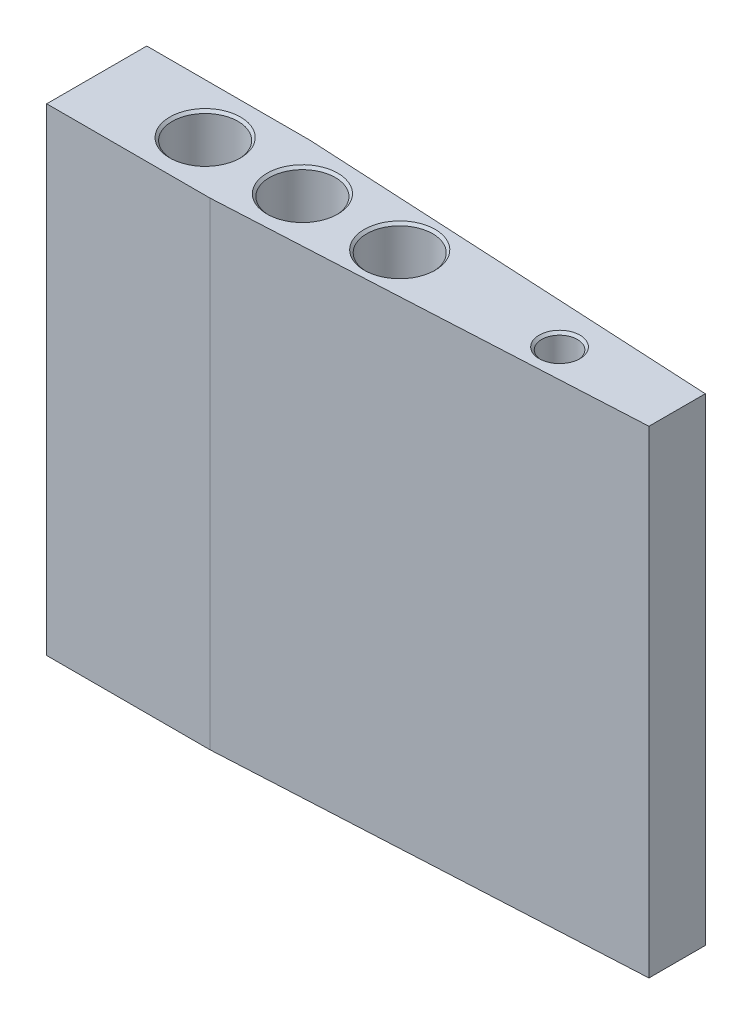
ISO-10303-21;
HEADER;
FILE_DESCRIPTION(('STEP AP214'),'2;1');
FILE_NAME('part.step','',(''),(''),'','','');
FILE_SCHEMA(('AUTOMOTIVE_DESIGN { 1 0 10303 214 1 1 1 1 }'));
ENDSEC;
DATA;
#1=APPLICATION_CONTEXT('core data for automotive mechanical design processes');
#2=APPLICATION_PROTOCOL_DEFINITION('international standard','automotive_design',2000,#1);
#3=PRODUCT_CONTEXT('',#1,'mechanical');
#4=PRODUCT('Part','Part','',(#3));
#5=PRODUCT_RELATED_PRODUCT_CATEGORY('part','',(#4));
#6=PRODUCT_DEFINITION_FORMATION('','',#4);
#7=PRODUCT_DEFINITION_CONTEXT('part definition',#1,'design');
#8=PRODUCT_DEFINITION('design','',#6,#7);
#9=PRODUCT_DEFINITION_SHAPE('','',#8);
#10=(LENGTH_UNIT() NAMED_UNIT(*) SI_UNIT(.MILLI.,.METRE.));
#11=(NAMED_UNIT(*) PLANE_ANGLE_UNIT() SI_UNIT($,.RADIAN.));
#12=(NAMED_UNIT(*) SI_UNIT($,.STERADIAN.) SOLID_ANGLE_UNIT());
#13=UNCERTAINTY_MEASURE_WITH_UNIT(LENGTH_MEASURE(1.E-05),#10,'distance_accuracy_value','');
#14=(GEOMETRIC_REPRESENTATION_CONTEXT(3) GLOBAL_UNCERTAINTY_ASSIGNED_CONTEXT((#13)) GLOBAL_UNIT_ASSIGNED_CONTEXT((#10,
#11,#12)) REPRESENTATION_CONTEXT('',''));
#15=CARTESIAN_POINT('',(0.,0.,0.));
#16=DIRECTION('',(0.,0.,1.));
#17=DIRECTION('',(1.,0.,0.));
#18=AXIS2_PLACEMENT_3D('',#15,#16,#17);
#19=CARTESIAN_POINT('',(19.5809830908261,68.2269070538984,-6.));
#20=DIRECTION('',(-0.0523359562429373,0.,0.998629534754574));
#21=DIRECTION('',(0.998629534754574,0.,0.0523359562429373));
#22=AXIS2_PLACEMENT_3D('',#19,#20,#21);
#23=PLANE('',#22);
#24=DIRECTION('',(-0.998629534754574,0.,-0.0523359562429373));
#25=VECTOR('',#24,1.);
#26=CARTESIAN_POINT('',(19.5809830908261,-2.4,-6.));
#27=LINE('',#26,#25);
#28=CARTESIAN_POINT('',(69.6,-2.4,-3.37861440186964));
#29=VERTEX_POINT('',#28);
#30=CARTESIAN_POINT('',(19.5809830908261,-2.4,-6.));
#31=VERTEX_POINT('',#30);
#32=EDGE_CURVE('E117',#29,#31,#27,.T.);
#33=ORIENTED_EDGE('',*,*,#32,.F.);
#34=DIRECTION('',(0.,-1.,0.));
#35=VECTOR('',#34,1.);
#36=CARTESIAN_POINT('',(69.6,68.2269070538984,-3.37861440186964));
#37=LINE('',#36,#35);
#38=CARTESIAN_POINT('',(69.6,-59.7,-3.37861440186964));
#39=VERTEX_POINT('',#38);
#40=EDGE_CURVE('E52',#29,#39,#37,.T.);
#41=ORIENTED_EDGE('',*,*,#40,.T.);
#42=DIRECTION('',(-0.998629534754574,0.,-0.0523359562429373));
#43=VECTOR('',#42,1.);
#44=CARTESIAN_POINT('',(19.5809830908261,-59.7,-6.));
#45=LINE('',#44,#43);
#46=CARTESIAN_POINT('',(19.5809830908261,-59.7,-6.));
#47=VERTEX_POINT('',#46);
#48=EDGE_CURVE('E125',#39,#47,#45,.T.);
#49=ORIENTED_EDGE('',*,*,#48,.T.);
#50=DIRECTION('',(0.,-1.,0.));
#51=VECTOR('',#50,1.);
#52=CARTESIAN_POINT('',(19.5809830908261,68.2269070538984,-6.));
#53=LINE('',#52,#51);
#54=EDGE_CURVE('E83',#31,#47,#53,.T.);
#55=ORIENTED_EDGE('',*,*,#54,.F.);
#56=EDGE_LOOP('',(#33,#41,#49,#55));
#57=FACE_BOUND('',#56,.T.);
#58=ADVANCED_FACE('F35',(#57),#23,.F.);
#59=CARTESIAN_POINT('',(0.,68.2269070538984,-6.00000000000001));
#60=DIRECTION('',(0.,0.,1.));
#61=DIRECTION('',(1.,0.,0.));
#62=AXIS2_PLACEMENT_3D('',#59,#60,#61);
#63=PLANE('',#62);
#64=DIRECTION('',(-1.,0.,0.));
#65=VECTOR('',#64,1.);
#66=CARTESIAN_POINT('',(0.,-2.4,-6.00000000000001));
#67=LINE('',#66,#65);
#68=CARTESIAN_POINT('',(0.,-2.4,-6.00000000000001));
#69=VERTEX_POINT('',#68);
#70=EDGE_CURVE('E90',#31,#69,#67,.T.);
#71=ORIENTED_EDGE('',*,*,#70,.F.);
#72=ORIENTED_EDGE('',*,*,#54,.T.);
#73=DIRECTION('',(-1.,0.,0.));
#74=VECTOR('',#73,1.);
#75=CARTESIAN_POINT('',(0.,-59.7,-6.00000000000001));
#76=LINE('',#75,#74);
#77=CARTESIAN_POINT('',(0.,-59.7,-6.00000000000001));
#78=VERTEX_POINT('',#77);
#79=EDGE_CURVE('E124',#47,#78,#76,.T.);
#80=ORIENTED_EDGE('',*,*,#79,.T.);
#81=DIRECTION('',(0.,-1.,0.));
#82=VECTOR('',#81,1.);
#83=CARTESIAN_POINT('',(0.,68.2269070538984,-6.00000000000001));
#84=LINE('',#83,#82);
#85=EDGE_CURVE('E126',#69,#78,#84,.T.);
#86=ORIENTED_EDGE('',*,*,#85,.F.);
#87=EDGE_LOOP('',(#71,#72,#80,#86));
#88=FACE_BOUND('',#87,.T.);
#89=ADVANCED_FACE('F150',(#88),#63,.F.);
#90=CARTESIAN_POINT('',(0.,68.2269070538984,-6.00000000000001));
#91=DIRECTION('',(1.,0.,0.));
#92=DIRECTION('',(0.,0.,-1.));
#93=AXIS2_PLACEMENT_3D('',#90,#91,#92);
#94=PLANE('',#93);
#95=DIRECTION('',(0.,0.,1.));
#96=VECTOR('',#95,1.);
#97=CARTESIAN_POINT('',(0.,-2.4,-6.00000000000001));
#98=LINE('',#97,#96);
#99=CARTESIAN_POINT('',(0.,-2.4,5.99999999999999));
#100=VERTEX_POINT('',#99);
#101=EDGE_CURVE('E111',#69,#100,#98,.T.);
#102=ORIENTED_EDGE('',*,*,#101,.F.);
#103=ORIENTED_EDGE('',*,*,#85,.T.);
#104=DIRECTION('',(0.,0.,1.));
#105=VECTOR('',#104,1.);
#106=CARTESIAN_POINT('',(0.,-59.7,-6.00000000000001));
#107=LINE('',#106,#105);
#108=CARTESIAN_POINT('',(0.,-59.7,5.99999999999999));
#109=VERTEX_POINT('',#108);
#110=EDGE_CURVE('E128',#78,#109,#107,.T.);
#111=ORIENTED_EDGE('',*,*,#110,.T.);
#112=DIRECTION('',(0.,-1.,0.));
#113=VECTOR('',#112,1.);
#114=CARTESIAN_POINT('',(0.,68.2269070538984,5.99999999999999));
#115=LINE('',#114,#113);
#116=EDGE_CURVE('E129',#100,#109,#115,.T.);
#117=ORIENTED_EDGE('',*,*,#116,.F.);
#118=EDGE_LOOP('',(#102,#103,#111,#117));
#119=FACE_BOUND('',#118,.T.);
#120=ADVANCED_FACE('F155',(#119),#94,.F.);
#121=CARTESIAN_POINT('',(19.5809830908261,68.2269070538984,5.99999999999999));
#122=DIRECTION('',(0.,0.,-1.));
#123=DIRECTION('',(-1.,0.,0.));
#124=AXIS2_PLACEMENT_3D('',#121,#122,#123);
#125=PLANE('',#124);
#126=DIRECTION('',(1.,0.,0.));
#127=VECTOR('',#126,1.);
#128=CARTESIAN_POINT('',(19.5809830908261,-2.4,5.99999999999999));
#129=LINE('',#128,#127);
#130=CARTESIAN_POINT('',(19.5809830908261,-2.4,5.99999999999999));
#131=VERTEX_POINT('',#130);
#132=EDGE_CURVE('E44',#100,#131,#129,.T.);
#133=ORIENTED_EDGE('',*,*,#132,.F.);
#134=ORIENTED_EDGE('',*,*,#116,.T.);
#135=DIRECTION('',(1.,0.,0.));
#136=VECTOR('',#135,1.);
#137=CARTESIAN_POINT('',(19.5809830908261,-59.7,5.99999999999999));
#138=LINE('',#137,#136);
#139=CARTESIAN_POINT('',(19.5809830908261,-59.7,5.99999999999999));
#140=VERTEX_POINT('',#139);
#141=EDGE_CURVE('E106',#109,#140,#138,.T.);
#142=ORIENTED_EDGE('',*,*,#141,.T.);
#143=DIRECTION('',(0.,-1.,0.));
#144=VECTOR('',#143,1.);
#145=CARTESIAN_POINT('',(19.5809830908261,68.2269070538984,5.99999999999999));
#146=LINE('',#145,#144);
#147=EDGE_CURVE('E97',#131,#140,#146,.T.);
#148=ORIENTED_EDGE('',*,*,#147,.F.);
#149=EDGE_LOOP('',(#133,#134,#142,#148));
#150=FACE_BOUND('',#149,.T.);
#151=ADVANCED_FACE('F103',(#150),#125,.F.);
#152=CARTESIAN_POINT('',(69.6,68.2269070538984,3.37861440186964));
#153=DIRECTION('',(-0.0523359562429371,0.,-0.998629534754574));
#154=DIRECTION('',(-0.998629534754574,0.,0.0523359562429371));
#155=AXIS2_PLACEMENT_3D('',#152,#153,#154);
#156=PLANE('',#155);
#157=DIRECTION('',(0.998629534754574,0.,-0.0523359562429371));
#158=VECTOR('',#157,1.);
#159=CARTESIAN_POINT('',(69.6,-2.4,3.37861440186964));
#160=LINE('',#159,#158);
#161=CARTESIAN_POINT('',(69.6,-2.4,3.37861440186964));
#162=VERTEX_POINT('',#161);
#163=EDGE_CURVE('E11',#131,#162,#160,.T.);
#164=ORIENTED_EDGE('',*,*,#163,.F.);
#165=ORIENTED_EDGE('',*,*,#147,.T.);
#166=DIRECTION('',(0.998629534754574,0.,-0.0523359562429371));
#167=VECTOR('',#166,1.);
#168=CARTESIAN_POINT('',(69.6,-59.7,3.37861440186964));
#169=LINE('',#168,#167);
#170=CARTESIAN_POINT('',(69.6,-59.7,3.37861440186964));
#171=VERTEX_POINT('',#170);
#172=EDGE_CURVE('E108',#140,#171,#169,.T.);
#173=ORIENTED_EDGE('',*,*,#172,.T.);
#174=DIRECTION('',(0.,-1.,0.));
#175=VECTOR('',#174,1.);
#176=CARTESIAN_POINT('',(69.6,68.2269070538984,3.37861440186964));
#177=LINE('',#176,#175);
#178=EDGE_CURVE('E58',#162,#171,#177,.T.);
#179=ORIENTED_EDGE('',*,*,#178,.F.);
#180=EDGE_LOOP('',(#164,#165,#173,#179));
#181=FACE_BOUND('',#180,.T.);
#182=ADVANCED_FACE('F96',(#181),#156,.F.);
#183=CARTESIAN_POINT('',(69.6,68.2269070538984,-3.37861440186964));
#184=DIRECTION('',(-1.,0.,0.));
#185=DIRECTION('',(0.,0.,1.));
#186=AXIS2_PLACEMENT_3D('',#183,#184,#185);
#187=PLANE('',#186);
#188=DIRECTION('',(0.,0.,-1.));
#189=VECTOR('',#188,1.);
#190=CARTESIAN_POINT('',(69.6,-2.4,-3.37861440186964));
#191=LINE('',#190,#189);
#192=EDGE_CURVE('E120',#162,#29,#191,.T.);
#193=ORIENTED_EDGE('',*,*,#192,.F.);
#194=ORIENTED_EDGE('',*,*,#178,.T.);
#195=DIRECTION('',(0.,0.,-1.));
#196=VECTOR('',#195,1.);
#197=CARTESIAN_POINT('',(69.6,-59.7,-3.37861440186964));
#198=LINE('',#197,#196);
#199=EDGE_CURVE('E122',#171,#39,#198,.T.);
#200=ORIENTED_EDGE('',*,*,#199,.T.);
#201=ORIENTED_EDGE('',*,*,#40,.F.);
#202=EDGE_LOOP('',(#193,#194,#200,#201));
#203=FACE_BOUND('',#202,.T.);
#204=ADVANCED_FACE('F167',(#203),#187,.F.);
#205=CARTESIAN_POINT('',(0.,-59.7,0.));
#206=DIRECTION('',(0.,-1.,0.));
#207=DIRECTION('',(0.,0.,-1.));
#208=AXIS2_PLACEMENT_3D('',#205,#206,#207);
#209=PLANE('',#208);
#210=CARTESIAN_POINT('',(56.0000000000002,-59.7,0.5));
#211=DIRECTION('',(0.,-1.,0.));
#212=DIRECTION('',(1.,0.,0.));
#213=AXIS2_PLACEMENT_3D('',#210,#211,#212);
#214=CIRCLE('',#213,2.1499999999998);
#215=CARTESIAN_POINT('',(58.15,-59.7,0.5));
#216=VERTEX_POINT('',#215);
#217=EDGE_CURVE('E249',#216,#216,#214,.T.);
#218=ORIENTED_EDGE('',*,*,#217,.F.);
#219=EDGE_LOOP('',(#218));
#220=FACE_BOUND('',#219,.T.);
#221=CARTESIAN_POINT('',(13.,-59.7,0.));
#222=DIRECTION('',(0.,-1.,0.));
#223=DIRECTION('',(0.,0.,-1.));
#224=AXIS2_PLACEMENT_3D('',#221,#222,#223);
#225=CIRCLE('',#224,1.3);
#226=CARTESIAN_POINT('',(13.,-59.7,-1.3));
#227=VERTEX_POINT('',#226);
#228=EDGE_CURVE('E256',#227,#227,#225,.T.);
#229=ORIENTED_EDGE('',*,*,#228,.F.);
#230=EDGE_LOOP('',(#229));
#231=FACE_BOUND('',#230,.T.);
#232=CARTESIAN_POINT('',(24.6666666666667,-59.7,0.));
#233=DIRECTION('',(0.,-1.,0.));
#234=DIRECTION('',(0.,0.,-1.));
#235=AXIS2_PLACEMENT_3D('',#232,#233,#234);
#236=CIRCLE('',#235,0.5);
#237=CARTESIAN_POINT('',(24.6666666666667,-59.7,-0.5));
#238=VERTEX_POINT('',#237);
#239=EDGE_CURVE('E262',#238,#238,#236,.T.);
#240=ORIENTED_EDGE('',*,*,#239,.F.);
#241=EDGE_LOOP('',(#240));
#242=FACE_BOUND('',#241,.T.);
#243=CARTESIAN_POINT('',(36.3333333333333,-59.7,0.));
#244=DIRECTION('',(0.,-1.,0.));
#245=DIRECTION('',(0.,0.,-1.));
#246=AXIS2_PLACEMENT_3D('',#243,#244,#245);
#247=CIRCLE('',#246,0.5);
#248=CARTESIAN_POINT('',(36.3333333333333,-59.7,-0.5));
#249=VERTEX_POINT('',#248);
#250=EDGE_CURVE('E289',#249,#249,#247,.T.);
#251=ORIENTED_EDGE('',*,*,#250,.F.);
#252=EDGE_LOOP('',(#251));
#253=FACE_BOUND('',#252,.T.);
#254=ORIENTED_EDGE('',*,*,#48,.F.);
#255=ORIENTED_EDGE('',*,*,#199,.F.);
#256=ORIENTED_EDGE('',*,*,#172,.F.);
#257=ORIENTED_EDGE('',*,*,#141,.F.);
#258=ORIENTED_EDGE('',*,*,#110,.F.);
#259=ORIENTED_EDGE('',*,*,#79,.F.);
#260=EDGE_LOOP('',(#254,#255,#256,#257,#258,#259));
#261=FACE_BOUND('',#260,.T.);
#262=ADVANCED_FACE('F153',(#220,#231,#242,#253,#261),#209,.T.);
#263=CARTESIAN_POINT('',(0.,-2.4,0.));
#264=DIRECTION('',(0.,1.,0.));
#265=DIRECTION('',(0.,0.,1.));
#266=AXIS2_PLACEMENT_3D('',#263,#264,#265);
#267=PLANE('',#266);
#268=CARTESIAN_POINT('',(56.,-2.39999999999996,0.5));
#269=DIRECTION('',(0.,-1.,0.));
#270=DIRECTION('',(1.,0.,0.));
#271=AXIS2_PLACEMENT_3D('',#268,#269,#270);
#272=CIRCLE('',#271,2.44999999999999);
#273=CARTESIAN_POINT('',(58.45,-2.39999999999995,0.5));
#274=VERTEX_POINT('',#273);
#275=EDGE_CURVE('E251',#274,#274,#272,.T.);
#276=ORIENTED_EDGE('',*,*,#275,.T.);
#277=EDGE_LOOP('',(#276));
#278=FACE_BOUND('',#277,.T.);
#279=CARTESIAN_POINT('',(24.6666666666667,-2.39999999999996,0.));
#280=DIRECTION('',(0.,-1.,0.));
#281=DIRECTION('',(0.,0.,-1.));
#282=AXIS2_PLACEMENT_3D('',#279,#280,#281);
#283=CIRCLE('',#282,4.25);
#284=CARTESIAN_POINT('',(24.6666666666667,-2.39999999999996,-4.25));
#285=VERTEX_POINT('',#284);
#286=EDGE_CURVE('E274',#285,#285,#283,.T.);
#287=ORIENTED_EDGE('',*,*,#286,.T.);
#288=EDGE_LOOP('',(#287));
#289=FACE_BOUND('',#288,.T.);
#290=CARTESIAN_POINT('',(13.,-2.39999999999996,0.));
#291=DIRECTION('',(0.,-1.,0.));
#292=DIRECTION('',(0.,0.,-1.));
#293=AXIS2_PLACEMENT_3D('',#290,#291,#292);
#294=CIRCLE('',#293,4.25);
#295=CARTESIAN_POINT('',(13.,-2.39999999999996,-4.25));
#296=VERTEX_POINT('',#295);
#297=EDGE_CURVE('E286',#296,#296,#294,.T.);
#298=ORIENTED_EDGE('',*,*,#297,.T.);
#299=EDGE_LOOP('',(#298));
#300=FACE_BOUND('',#299,.T.);
#301=CARTESIAN_POINT('',(36.3333333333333,-2.39999999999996,0.));
#302=DIRECTION('',(0.,-1.,0.));
#303=DIRECTION('',(0.,0.,-1.));
#304=AXIS2_PLACEMENT_3D('',#301,#302,#303);
#305=CIRCLE('',#304,4.25);
#306=CARTESIAN_POINT('',(36.3333333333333,-2.39999999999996,-4.25));
#307=VERTEX_POINT('',#306);
#308=EDGE_CURVE('E131',#307,#307,#305,.T.);
#309=ORIENTED_EDGE('',*,*,#308,.T.);
#310=EDGE_LOOP('',(#309));
#311=FACE_BOUND('',#310,.T.);
#312=ORIENTED_EDGE('',*,*,#192,.T.);
#313=ORIENTED_EDGE('',*,*,#32,.T.);
#314=ORIENTED_EDGE('',*,*,#70,.T.);
#315=ORIENTED_EDGE('',*,*,#101,.T.);
#316=ORIENTED_EDGE('',*,*,#132,.T.);
#317=ORIENTED_EDGE('',*,*,#163,.T.);
#318=EDGE_LOOP('',(#312,#313,#314,#315,#316,#317));
#319=FACE_BOUND('',#318,.T.);
#320=ADVANCED_FACE('F37',(#278,#289,#300,#311,#319),#267,.T.);
#321=CARTESIAN_POINT('',(36.3333333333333,-2.70000000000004,0.));
#322=DIRECTION('',(0.,1.,0.));
#323=DIRECTION('',(0.,0.,1.));
#324=AXIS2_PLACEMENT_3D('',#321,#322,#323);
#325=CONICAL_SURFACE('',#324,3.95,0.785398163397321);
#326=ORIENTED_EDGE('',*,*,#308,.F.);
#327=EDGE_LOOP('',(#326));
#328=FACE_BOUND('',#327,.T.);
#329=CARTESIAN_POINT('',(36.3333333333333,-2.70000000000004,0.));
#330=DIRECTION('',(0.,-1.,0.));
#331=DIRECTION('',(0.,0.,-1.));
#332=AXIS2_PLACEMENT_3D('',#329,#330,#331);
#333=CIRCLE('',#332,3.95);
#334=CARTESIAN_POINT('',(36.3333333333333,-2.70000000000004,-3.95));
#335=VERTEX_POINT('',#334);
#336=EDGE_CURVE('E135',#335,#335,#333,.T.);
#337=ORIENTED_EDGE('',*,*,#336,.T.);
#338=EDGE_LOOP('',(#337));
#339=FACE_BOUND('',#338,.T.);
#340=ADVANCED_FACE('F178',(#328,#339),#325,.F.);
#341=CARTESIAN_POINT('',(36.3333333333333,-992.668015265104,0.));
#342=DIRECTION('',(0.,-1.,0.));
#343=DIRECTION('',(0.,0.,-1.));
#344=AXIS2_PLACEMENT_3D('',#341,#342,#343);
#345=CYLINDRICAL_SURFACE('',#344,3.95000000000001);
#346=ORIENTED_EDGE('',*,*,#336,.F.);
#347=EDGE_LOOP('',(#346));
#348=FACE_BOUND('',#347,.T.);
#349=CARTESIAN_POINT('',(36.3333333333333,-52.7081415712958,0.));
#350=DIRECTION('',(0.,-1.,0.));
#351=DIRECTION('',(0.,0.,-1.));
#352=AXIS2_PLACEMENT_3D('',#349,#350,#351);
#353=CIRCLE('',#352,3.95000000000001);
#354=CARTESIAN_POINT('',(36.3333333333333,-52.7081415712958,3.95000000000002));
#355=VERTEX_POINT('',#354);
#356=EDGE_CURVE('E140',#355,#355,#353,.T.);
#357=ORIENTED_EDGE('',*,*,#356,.T.);
#358=EDGE_LOOP('',(#357));
#359=FACE_BOUND('',#358,.T.);
#360=ADVANCED_FACE('F181',(#348,#359),#345,.F.);
#361=CARTESIAN_POINT('',(36.3333333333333,-54.7,0.));
#362=DIRECTION('',(0.,1.,0.));
#363=DIRECTION('',(0.,0.,1.));
#364=AXIS2_PLACEMENT_3D('',#361,#362,#363);
#365=CONICAL_SURFACE('',#364,0.499999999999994,1.0471975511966);
#366=CARTESIAN_POINT('',(36.3333333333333,-54.7,0.));
#367=DIRECTION('',(0.,-1.,0.));
#368=DIRECTION('',(0.,0.,-1.));
#369=AXIS2_PLACEMENT_3D('',#366,#367,#368);
#370=CIRCLE('',#369,0.499999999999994);
#371=CARTESIAN_POINT('',(36.3333333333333,-54.7,0.499999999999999));
#372=VERTEX_POINT('',#371);
#373=EDGE_CURVE('E292',#372,#372,#370,.T.);
#374=CARTESIAN_POINT('',(36.3333333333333,-52.7081415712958,3.95000000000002));
#375=CARTESIAN_POINT('',(36.3333333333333,-52.7288900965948,3.91406250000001));
#376=CARTESIAN_POINT('',(36.3333333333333,-52.7496386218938,3.87812500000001));
#377=CARTESIAN_POINT('',(36.3333333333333,-52.7911356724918,3.80625000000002));
#378=CARTESIAN_POINT('',(36.3333333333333,-52.8118841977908,3.77031250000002));
#379=CARTESIAN_POINT('',(36.3333333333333,-52.8533812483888,3.69843750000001));
#380=CARTESIAN_POINT('',(36.3333333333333,-52.8741297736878,3.66250000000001));
#381=CARTESIAN_POINT('',(36.3333333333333,-52.9156268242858,3.59062500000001));
#382=CARTESIAN_POINT('',(36.3333333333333,-52.9363753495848,3.55468750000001));
#383=CARTESIAN_POINT('',(36.3333333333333,-52.9778724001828,3.48281250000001));
#384=CARTESIAN_POINT('',(36.3333333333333,-52.9986209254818,3.44687500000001));
#385=CARTESIAN_POINT('',(36.3333333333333,-53.0401179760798,3.37500000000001));
#386=CARTESIAN_POINT('',(36.3333333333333,-53.0608665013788,3.33906250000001));
#387=CARTESIAN_POINT('',(36.3333333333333,-53.1023635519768,3.26718750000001));
#388=CARTESIAN_POINT('',(36.3333333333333,-53.1231120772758,3.23125000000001));
#389=CARTESIAN_POINT('',(36.3333333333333,-53.1646091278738,3.15937500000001));
#390=CARTESIAN_POINT('',(36.3333333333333,-53.1853576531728,3.12343750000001));
#391=CARTESIAN_POINT('',(36.3333333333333,-53.2268547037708,3.05156250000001));
#392=CARTESIAN_POINT('',(36.3333333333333,-53.2476032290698,3.01562500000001));
#393=CARTESIAN_POINT('',(36.3333333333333,-53.2891002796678,2.94375000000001));
#394=CARTESIAN_POINT('',(36.3333333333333,-53.3098488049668,2.90781250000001));
#395=CARTESIAN_POINT('',(36.3333333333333,-53.3513458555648,2.83593750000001));
#396=CARTESIAN_POINT('',(36.3333333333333,-53.3720943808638,2.80000000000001));
#397=CARTESIAN_POINT('',(36.3333333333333,-53.4135914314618,2.72812500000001));
#398=CARTESIAN_POINT('',(36.3333333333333,-53.4343399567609,2.69218750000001));
#399=CARTESIAN_POINT('',(36.3333333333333,-53.4758370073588,2.62031250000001));
#400=CARTESIAN_POINT('',(36.3333333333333,-53.4965855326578,2.58437500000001));
#401=CARTESIAN_POINT('',(36.3333333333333,-53.5380825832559,2.51250000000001));
#402=CARTESIAN_POINT('',(36.3333333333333,-53.5588311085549,2.47656250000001));
#403=CARTESIAN_POINT('',(36.3333333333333,-53.6003281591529,2.40468750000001));
#404=CARTESIAN_POINT('',(36.3333333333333,-53.6210766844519,2.36875000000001));
#405=CARTESIAN_POINT('',(36.3333333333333,-53.6625737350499,2.29687500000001));
#406=CARTESIAN_POINT('',(36.3333333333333,-53.6833222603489,2.26093750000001));
#407=CARTESIAN_POINT('',(36.3333333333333,-53.7248193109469,2.18906250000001));
#408=CARTESIAN_POINT('',(36.3333333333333,-53.7455678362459,2.15312500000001));
#409=CARTESIAN_POINT('',(36.3333333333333,-53.7870648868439,2.08125000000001));
#410=CARTESIAN_POINT('',(36.3333333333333,-53.8078134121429,2.04531250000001));
#411=CARTESIAN_POINT('',(36.3333333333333,-53.8493104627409,1.97343750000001));
#412=CARTESIAN_POINT('',(36.3333333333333,-53.8700589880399,1.93750000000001));
#413=CARTESIAN_POINT('',(36.3333333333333,-53.9115560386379,1.865625));
#414=CARTESIAN_POINT('',(36.3333333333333,-53.9323045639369,1.82968750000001));
#415=CARTESIAN_POINT('',(36.3333333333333,-53.9738016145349,1.75781250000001));
#416=CARTESIAN_POINT('',(36.3333333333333,-53.9945501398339,1.721875));
#417=CARTESIAN_POINT('',(36.3333333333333,-54.0360471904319,1.65));
#418=CARTESIAN_POINT('',(36.3333333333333,-54.0567957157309,1.61406250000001));
#419=CARTESIAN_POINT('',(36.3333333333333,-54.0982927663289,1.54218750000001));
#420=CARTESIAN_POINT('',(36.3333333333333,-54.1190412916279,1.50625));
#421=CARTESIAN_POINT('',(36.3333333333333,-54.1605383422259,1.434375));
#422=CARTESIAN_POINT('',(36.3333333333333,-54.1812868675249,1.3984375));
#423=CARTESIAN_POINT('',(36.3333333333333,-54.2227839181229,1.3265625));
#424=CARTESIAN_POINT('',(36.3333333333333,-54.2435324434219,1.290625));
#425=CARTESIAN_POINT('',(36.3333333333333,-54.2850294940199,1.21875));
#426=CARTESIAN_POINT('',(36.3333333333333,-54.3057780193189,1.1828125));
#427=CARTESIAN_POINT('',(36.3333333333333,-54.3472750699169,1.1109375));
#428=CARTESIAN_POINT('',(36.3333333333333,-54.3680235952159,1.075));
#429=CARTESIAN_POINT('',(36.3333333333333,-54.4095206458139,1.003125));
#430=CARTESIAN_POINT('',(36.3333333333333,-54.4302691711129,0.967187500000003));
#431=CARTESIAN_POINT('',(36.3333333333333,-54.4717662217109,0.895312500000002));
#432=CARTESIAN_POINT('',(36.3333333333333,-54.4925147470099,0.859375));
#433=CARTESIAN_POINT('',(36.3333333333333,-54.5340117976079,0.7875));
#434=CARTESIAN_POINT('',(36.3333333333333,-54.554760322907,0.751562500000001));
#435=CARTESIAN_POINT('',(36.3333333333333,-54.596257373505,0.679687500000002));
#436=CARTESIAN_POINT('',(36.3333333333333,-54.617005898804,0.64375));
#437=CARTESIAN_POINT('',(36.3333333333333,-54.658502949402,0.571874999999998));
#438=CARTESIAN_POINT('',(36.3333333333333,-54.679251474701,0.535937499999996));
#439=CARTESIAN_POINT('',(36.3333333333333,-54.7,0.499999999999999));
#440=B_SPLINE_CURVE_WITH_KNOTS('',3,(#374,#375,#376,#377,#378,#379,#380,#381,#382,#383,#384,
#385,#386,#387,#388,#389,#390,#391,#392,#393,#394,#395,#396,#397,#398,#399,#400,#401,#402,#403,
#404,#405,#406,#407,#408,#409,#410,#411,#412,#413,#414,#415,#416,#417,#418,#419,#420,#421,#422,
#423,#424,#425,#426,#427,#428,#429,#430,#431,#432,#433,#434,#435,#436,#437,#438,#439),
.UNSPECIFIED.,.F.,.F.,(4,2,2,2,2,2,2,2,2,2,2,2,2,2,2,2,2,2,2,2,2,2,2,2,2,2,2,2,2,2,2,2,4),(0.,
0.12449115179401,0.248982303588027,0.373473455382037,0.497964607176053,0.622455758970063,
0.74694691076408,0.87143806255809,0.995929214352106,1.12042036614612,1.24491151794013,
1.36940266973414,1.49389382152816,1.61838497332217,1.74287612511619,1.8673672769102,
1.99185842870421,2.11634958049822,2.24084073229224,2.36533188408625,2.48982303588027,
2.61431418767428,2.73880533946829,2.8632964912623,2.98778764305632,3.11227879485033,
3.23676994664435,3.36126109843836,3.48575225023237,3.61024340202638,3.7347345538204,
3.85922570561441,3.98371685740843),.UNSPECIFIED.);
#441=EDGE_CURVE('BSEAM185',#355,#372,#440,.T.);
#442=ORIENTED_EDGE('',*,*,#356,.F.);
#443=ORIENTED_EDGE('',*,*,#373,.T.);
#444=ORIENTED_EDGE('',*,*,#441,.T.);
#445=ORIENTED_EDGE('',*,*,#441,.F.);
#446=EDGE_LOOP('',(#442,#444,#443,#445));
#447=FACE_BOUND('',#446,.T.);
#448=ADVANCED_FACE('F185',(#447),#365,.F.);
#449=CARTESIAN_POINT('',(36.3333333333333,-992.668015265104,0.));
#450=DIRECTION('',(0.,-1.,0.));
#451=DIRECTION('',(0.,0.,-1.));
#452=AXIS2_PLACEMENT_3D('',#449,#450,#451);
#453=CYLINDRICAL_SURFACE('',#452,0.499999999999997);
#454=ORIENTED_EDGE('',*,*,#373,.F.);
#455=EDGE_LOOP('',(#454));
#456=FACE_BOUND('',#455,.T.);
#457=ORIENTED_EDGE('',*,*,#250,.T.);
#458=EDGE_LOOP('',(#457));
#459=FACE_BOUND('',#458,.T.);
#460=ADVANCED_FACE('F189',(#456,#459),#453,.F.);
#461=CARTESIAN_POINT('',(13.,-2.70000000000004,0.));
#462=DIRECTION('',(0.,1.,0.));
#463=DIRECTION('',(0.,0.,1.));
#464=AXIS2_PLACEMENT_3D('',#461,#462,#463);
#465=CONICAL_SURFACE('',#464,3.95,0.785398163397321);
#466=ORIENTED_EDGE('',*,*,#297,.F.);
#467=EDGE_LOOP('',(#466));
#468=FACE_BOUND('',#467,.T.);
#469=CARTESIAN_POINT('',(13.,-2.70000000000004,0.));
#470=DIRECTION('',(0.,-1.,0.));
#471=DIRECTION('',(0.,0.,-1.));
#472=AXIS2_PLACEMENT_3D('',#469,#470,#471);
#473=CIRCLE('',#472,3.95);
#474=CARTESIAN_POINT('',(13.,-2.70000000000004,-3.95));
#475=VERTEX_POINT('',#474);
#476=EDGE_CURVE('E283',#475,#475,#473,.T.);
#477=ORIENTED_EDGE('',*,*,#476,.T.);
#478=EDGE_LOOP('',(#477));
#479=FACE_BOUND('',#478,.T.);
#480=ADVANCED_FACE('F193',(#468,#479),#465,.F.);
#481=CARTESIAN_POINT('',(13.,-992.668015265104,0.));
#482=DIRECTION('',(0.,-1.,0.));
#483=DIRECTION('',(0.,0.,-1.));
#484=AXIS2_PLACEMENT_3D('',#481,#482,#483);
#485=CYLINDRICAL_SURFACE('',#484,3.95000000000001);
#486=ORIENTED_EDGE('',*,*,#476,.F.);
#487=EDGE_LOOP('',(#486));
#488=FACE_BOUND('',#487,.T.);
#489=CARTESIAN_POINT('',(13.,-52.7081415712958,0.));
#490=DIRECTION('',(0.,-1.,0.));
#491=DIRECTION('',(0.,0.,-1.));
#492=AXIS2_PLACEMENT_3D('',#489,#490,#491);
#493=CIRCLE('',#492,3.95000000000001);
#494=CARTESIAN_POINT('',(13.,-52.7081415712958,3.95000000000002));
#495=VERTEX_POINT('',#494);
#496=EDGE_CURVE('E280',#495,#495,#493,.T.);
#497=ORIENTED_EDGE('',*,*,#496,.T.);
#498=EDGE_LOOP('',(#497));
#499=FACE_BOUND('',#498,.T.);
#500=ADVANCED_FACE('F197',(#488,#499),#485,.F.);
#501=CARTESIAN_POINT('',(13.,-54.7,0.));
#502=DIRECTION('',(0.,1.,0.));
#503=DIRECTION('',(0.,0.,1.));
#504=AXIS2_PLACEMENT_3D('',#501,#502,#503);
#505=CONICAL_SURFACE('',#504,0.499999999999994,1.0471975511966);
#506=CARTESIAN_POINT('',(13.,-54.7,0.));
#507=DIRECTION('',(0.,-1.,0.));
#508=DIRECTION('',(0.,0.,-1.));
#509=AXIS2_PLACEMENT_3D('',#506,#507,#508);
#510=CIRCLE('',#509,0.499999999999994);
#511=CARTESIAN_POINT('',(13.,-54.7,0.499999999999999));
#512=VERTEX_POINT('',#511);
#513=EDGE_CURVE('E277',#512,#512,#510,.T.);
#514=CARTESIAN_POINT('',(13.,-52.7081415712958,3.95000000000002));
#515=CARTESIAN_POINT('',(13.,-52.7288900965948,3.91406250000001));
#516=CARTESIAN_POINT('',(13.,-52.7496386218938,3.87812500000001));
#517=CARTESIAN_POINT('',(13.,-52.7911356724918,3.80625000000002));
#518=CARTESIAN_POINT('',(13.,-52.8118841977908,3.77031250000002));
#519=CARTESIAN_POINT('',(13.,-52.8533812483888,3.69843750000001));
#520=CARTESIAN_POINT('',(13.,-52.8741297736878,3.66250000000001));
#521=CARTESIAN_POINT('',(13.,-52.9156268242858,3.59062500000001));
#522=CARTESIAN_POINT('',(13.,-52.9363753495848,3.55468750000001));
#523=CARTESIAN_POINT('',(13.,-52.9778724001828,3.48281250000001));
#524=CARTESIAN_POINT('',(13.,-52.9986209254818,3.44687500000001));
#525=CARTESIAN_POINT('',(13.,-53.0401179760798,3.37500000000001));
#526=CARTESIAN_POINT('',(13.,-53.0608665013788,3.33906250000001));
#527=CARTESIAN_POINT('',(13.,-53.1023635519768,3.26718750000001));
#528=CARTESIAN_POINT('',(13.,-53.1231120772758,3.23125000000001));
#529=CARTESIAN_POINT('',(13.,-53.1646091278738,3.15937500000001));
#530=CARTESIAN_POINT('',(13.,-53.1853576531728,3.12343750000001));
#531=CARTESIAN_POINT('',(13.,-53.2268547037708,3.05156250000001));
#532=CARTESIAN_POINT('',(13.,-53.2476032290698,3.01562500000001));
#533=CARTESIAN_POINT('',(13.,-53.2891002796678,2.94375000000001));
#534=CARTESIAN_POINT('',(13.,-53.3098488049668,2.90781250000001));
#535=CARTESIAN_POINT('',(13.,-53.3513458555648,2.83593750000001));
#536=CARTESIAN_POINT('',(13.,-53.3720943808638,2.80000000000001));
#537=CARTESIAN_POINT('',(13.,-53.4135914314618,2.72812500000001));
#538=CARTESIAN_POINT('',(13.,-53.4343399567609,2.69218750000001));
#539=CARTESIAN_POINT('',(13.,-53.4758370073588,2.62031250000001));
#540=CARTESIAN_POINT('',(13.,-53.4965855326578,2.58437500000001));
#541=CARTESIAN_POINT('',(13.,-53.5380825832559,2.51250000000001));
#542=CARTESIAN_POINT('',(13.,-53.5588311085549,2.47656250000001));
#543=CARTESIAN_POINT('',(13.,-53.6003281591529,2.40468750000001));
#544=CARTESIAN_POINT('',(13.,-53.6210766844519,2.36875000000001));
#545=CARTESIAN_POINT('',(13.,-53.6625737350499,2.29687500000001));
#546=CARTESIAN_POINT('',(13.,-53.6833222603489,2.26093750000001));
#547=CARTESIAN_POINT('',(13.,-53.7248193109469,2.18906250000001));
#548=CARTESIAN_POINT('',(13.,-53.7455678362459,2.15312500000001));
#549=CARTESIAN_POINT('',(13.,-53.7870648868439,2.08125000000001));
#550=CARTESIAN_POINT('',(13.,-53.8078134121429,2.04531250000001));
#551=CARTESIAN_POINT('',(13.,-53.8493104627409,1.97343750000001));
#552=CARTESIAN_POINT('',(13.,-53.8700589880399,1.93750000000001));
#553=CARTESIAN_POINT('',(13.,-53.9115560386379,1.865625));
#554=CARTESIAN_POINT('',(13.,-53.9323045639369,1.82968750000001));
#555=CARTESIAN_POINT('',(13.,-53.9738016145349,1.75781250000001));
#556=CARTESIAN_POINT('',(13.,-53.9945501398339,1.721875));
#557=CARTESIAN_POINT('',(13.,-54.0360471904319,1.65));
#558=CARTESIAN_POINT('',(13.,-54.0567957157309,1.61406250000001));
#559=CARTESIAN_POINT('',(13.,-54.0982927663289,1.54218750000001));
#560=CARTESIAN_POINT('',(13.,-54.1190412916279,1.50625));
#561=CARTESIAN_POINT('',(13.,-54.1605383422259,1.434375));
#562=CARTESIAN_POINT('',(13.,-54.1812868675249,1.3984375));
#563=CARTESIAN_POINT('',(13.,-54.2227839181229,1.3265625));
#564=CARTESIAN_POINT('',(13.,-54.2435324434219,1.290625));
#565=CARTESIAN_POINT('',(13.,-54.2850294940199,1.21875));
#566=CARTESIAN_POINT('',(13.,-54.3057780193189,1.1828125));
#567=CARTESIAN_POINT('',(13.,-54.3472750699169,1.1109375));
#568=CARTESIAN_POINT('',(13.,-54.3680235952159,1.075));
#569=CARTESIAN_POINT('',(13.,-54.4095206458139,1.003125));
#570=CARTESIAN_POINT('',(13.,-54.4302691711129,0.967187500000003));
#571=CARTESIAN_POINT('',(13.,-54.4717662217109,0.895312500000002));
#572=CARTESIAN_POINT('',(13.,-54.4925147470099,0.859375));
#573=CARTESIAN_POINT('',(13.,-54.5340117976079,0.7875));
#574=CARTESIAN_POINT('',(13.,-54.554760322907,0.751562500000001));
#575=CARTESIAN_POINT('',(13.,-54.596257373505,0.679687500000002));
#576=CARTESIAN_POINT('',(13.,-54.617005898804,0.64375));
#577=CARTESIAN_POINT('',(13.,-54.658502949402,0.571874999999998));
#578=CARTESIAN_POINT('',(13.,-54.679251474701,0.535937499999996));
#579=CARTESIAN_POINT('',(13.,-54.7,0.499999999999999));
#580=B_SPLINE_CURVE_WITH_KNOTS('',3,(#514,#515,#516,#517,#518,#519,#520,#521,#522,#523,#524,
#525,#526,#527,#528,#529,#530,#531,#532,#533,#534,#535,#536,#537,#538,#539,#540,#541,#542,#543,
#544,#545,#546,#547,#548,#549,#550,#551,#552,#553,#554,#555,#556,#557,#558,#559,#560,#561,#562,
#563,#564,#565,#566,#567,#568,#569,#570,#571,#572,#573,#574,#575,#576,#577,#578,#579),
.UNSPECIFIED.,.F.,.F.,(4,2,2,2,2,2,2,2,2,2,2,2,2,2,2,2,2,2,2,2,2,2,2,2,2,2,2,2,2,2,2,2,4),(0.,
0.12449115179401,0.248982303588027,0.373473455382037,0.497964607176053,0.622455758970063,
0.74694691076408,0.87143806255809,0.995929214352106,1.12042036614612,1.24491151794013,
1.36940266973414,1.49389382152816,1.61838497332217,1.74287612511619,1.8673672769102,
1.99185842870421,2.11634958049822,2.24084073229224,2.36533188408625,2.48982303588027,
2.61431418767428,2.73880533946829,2.8632964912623,2.98778764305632,3.11227879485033,
3.23676994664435,3.36126109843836,3.48575225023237,3.61024340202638,3.7347345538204,
3.85922570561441,3.98371685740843),.UNSPECIFIED.);
#581=EDGE_CURVE('BSEAM201',#495,#512,#580,.T.);
#582=ORIENTED_EDGE('',*,*,#496,.F.);
#583=ORIENTED_EDGE('',*,*,#513,.T.);
#584=ORIENTED_EDGE('',*,*,#581,.T.);
#585=ORIENTED_EDGE('',*,*,#581,.F.);
#586=EDGE_LOOP('',(#582,#584,#583,#585));
#587=FACE_BOUND('',#586,.T.);
#588=ADVANCED_FACE('F201',(#587),#505,.F.);
#589=CARTESIAN_POINT('',(13.,-992.668015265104,0.));
#590=DIRECTION('',(0.,-1.,0.));
#591=DIRECTION('',(0.,0.,-1.));
#592=AXIS2_PLACEMENT_3D('',#589,#590,#591);
#593=CYLINDRICAL_SURFACE('',#592,0.499999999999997);
#594=CARTESIAN_POINT('',(13.,-55.4,0.));
#595=DIRECTION('',(0.,-1.,0.));
#596=DIRECTION('',(0.,0.,-1.));
#597=AXIS2_PLACEMENT_3D('',#594,#595,#596);
#598=CIRCLE('',#597,0.499999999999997);
#599=CARTESIAN_POINT('',(13.,-55.4,-0.499999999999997));
#600=VERTEX_POINT('',#599);
#601=EDGE_CURVE('E39',#600,#600,#598,.T.);
#602=ORIENTED_EDGE('',*,*,#601,.T.);
#603=EDGE_LOOP('',(#602));
#604=FACE_BOUND('',#603,.T.);
#605=ORIENTED_EDGE('',*,*,#513,.F.);
#606=EDGE_LOOP('',(#605));
#607=FACE_BOUND('',#606,.T.);
#608=ADVANCED_FACE('F205',(#604,#607),#593,.F.);
#609=CARTESIAN_POINT('',(24.6666666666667,-2.70000000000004,0.));
#610=DIRECTION('',(0.,1.,0.));
#611=DIRECTION('',(0.,0.,1.));
#612=AXIS2_PLACEMENT_3D('',#609,#610,#611);
#613=CONICAL_SURFACE('',#612,3.95,0.785398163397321);
#614=ORIENTED_EDGE('',*,*,#286,.F.);
#615=EDGE_LOOP('',(#614));
#616=FACE_BOUND('',#615,.T.);
#617=CARTESIAN_POINT('',(24.6666666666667,-2.70000000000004,0.));
#618=DIRECTION('',(0.,-1.,0.));
#619=DIRECTION('',(0.,0.,-1.));
#620=AXIS2_PLACEMENT_3D('',#617,#618,#619);
#621=CIRCLE('',#620,3.95);
#622=CARTESIAN_POINT('',(24.6666666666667,-2.70000000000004,-3.95));
#623=VERTEX_POINT('',#622);
#624=EDGE_CURVE('E271',#623,#623,#621,.T.);
#625=ORIENTED_EDGE('',*,*,#624,.T.);
#626=EDGE_LOOP('',(#625));
#627=FACE_BOUND('',#626,.T.);
#628=ADVANCED_FACE('F209',(#616,#627),#613,.F.);
#629=CARTESIAN_POINT('',(24.6666666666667,-992.668015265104,0.));
#630=DIRECTION('',(0.,-1.,0.));
#631=DIRECTION('',(0.,0.,-1.));
#632=AXIS2_PLACEMENT_3D('',#629,#630,#631);
#633=CYLINDRICAL_SURFACE('',#632,3.95000000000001);
#634=ORIENTED_EDGE('',*,*,#624,.F.);
#635=EDGE_LOOP('',(#634));
#636=FACE_BOUND('',#635,.T.);
#637=CARTESIAN_POINT('',(24.6666666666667,-52.7081415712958,0.));
#638=DIRECTION('',(0.,-1.,0.));
#639=DIRECTION('',(0.,0.,-1.));
#640=AXIS2_PLACEMENT_3D('',#637,#638,#639);
#641=CIRCLE('',#640,3.95000000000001);
#642=CARTESIAN_POINT('',(24.6666666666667,-52.7081415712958,3.95000000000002));
#643=VERTEX_POINT('',#642);
#644=EDGE_CURVE('E268',#643,#643,#641,.T.);
#645=ORIENTED_EDGE('',*,*,#644,.T.);
#646=EDGE_LOOP('',(#645));
#647=FACE_BOUND('',#646,.T.);
#648=ADVANCED_FACE('F213',(#636,#647),#633,.F.);
#649=CARTESIAN_POINT('',(24.6666666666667,-54.7,0.));
#650=DIRECTION('',(0.,1.,0.));
#651=DIRECTION('',(0.,0.,1.));
#652=AXIS2_PLACEMENT_3D('',#649,#650,#651);
#653=CONICAL_SURFACE('',#652,0.499999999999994,1.0471975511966);
#654=CARTESIAN_POINT('',(24.6666666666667,-54.7,0.));
#655=DIRECTION('',(0.,-1.,0.));
#656=DIRECTION('',(0.,0.,-1.));
#657=AXIS2_PLACEMENT_3D('',#654,#655,#656);
#658=CIRCLE('',#657,0.499999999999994);
#659=CARTESIAN_POINT('',(24.6666666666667,-54.7,0.499999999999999));
#660=VERTEX_POINT('',#659);
#661=EDGE_CURVE('E265',#660,#660,#658,.T.);
#662=CARTESIAN_POINT('',(24.6666666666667,-52.7081415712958,3.95000000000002));
#663=CARTESIAN_POINT('',(24.6666666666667,-52.7288900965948,3.91406250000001));
#664=CARTESIAN_POINT('',(24.6666666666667,-52.7496386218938,3.87812500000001));
#665=CARTESIAN_POINT('',(24.6666666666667,-52.7911356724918,3.80625000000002));
#666=CARTESIAN_POINT('',(24.6666666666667,-52.8118841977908,3.77031250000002));
#667=CARTESIAN_POINT('',(24.6666666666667,-52.8533812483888,3.69843750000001));
#668=CARTESIAN_POINT('',(24.6666666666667,-52.8741297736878,3.66250000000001));
#669=CARTESIAN_POINT('',(24.6666666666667,-52.9156268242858,3.59062500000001));
#670=CARTESIAN_POINT('',(24.6666666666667,-52.9363753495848,3.55468750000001));
#671=CARTESIAN_POINT('',(24.6666666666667,-52.9778724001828,3.48281250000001));
#672=CARTESIAN_POINT('',(24.6666666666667,-52.9986209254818,3.44687500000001));
#673=CARTESIAN_POINT('',(24.6666666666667,-53.0401179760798,3.37500000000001));
#674=CARTESIAN_POINT('',(24.6666666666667,-53.0608665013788,3.33906250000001));
#675=CARTESIAN_POINT('',(24.6666666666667,-53.1023635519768,3.26718750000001));
#676=CARTESIAN_POINT('',(24.6666666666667,-53.1231120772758,3.23125000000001));
#677=CARTESIAN_POINT('',(24.6666666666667,-53.1646091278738,3.15937500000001));
#678=CARTESIAN_POINT('',(24.6666666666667,-53.1853576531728,3.12343750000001));
#679=CARTESIAN_POINT('',(24.6666666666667,-53.2268547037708,3.05156250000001));
#680=CARTESIAN_POINT('',(24.6666666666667,-53.2476032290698,3.01562500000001));
#681=CARTESIAN_POINT('',(24.6666666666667,-53.2891002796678,2.94375000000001));
#682=CARTESIAN_POINT('',(24.6666666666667,-53.3098488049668,2.90781250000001));
#683=CARTESIAN_POINT('',(24.6666666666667,-53.3513458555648,2.83593750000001));
#684=CARTESIAN_POINT('',(24.6666666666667,-53.3720943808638,2.80000000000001));
#685=CARTESIAN_POINT('',(24.6666666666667,-53.4135914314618,2.72812500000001));
#686=CARTESIAN_POINT('',(24.6666666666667,-53.4343399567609,2.69218750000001));
#687=CARTESIAN_POINT('',(24.6666666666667,-53.4758370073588,2.62031250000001));
#688=CARTESIAN_POINT('',(24.6666666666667,-53.4965855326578,2.58437500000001));
#689=CARTESIAN_POINT('',(24.6666666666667,-53.5380825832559,2.51250000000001));
#690=CARTESIAN_POINT('',(24.6666666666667,-53.5588311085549,2.47656250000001));
#691=CARTESIAN_POINT('',(24.6666666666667,-53.6003281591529,2.40468750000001));
#692=CARTESIAN_POINT('',(24.6666666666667,-53.6210766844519,2.36875000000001));
#693=CARTESIAN_POINT('',(24.6666666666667,-53.6625737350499,2.29687500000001));
#694=CARTESIAN_POINT('',(24.6666666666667,-53.6833222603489,2.26093750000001));
#695=CARTESIAN_POINT('',(24.6666666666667,-53.7248193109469,2.18906250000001));
#696=CARTESIAN_POINT('',(24.6666666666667,-53.7455678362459,2.15312500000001));
#697=CARTESIAN_POINT('',(24.6666666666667,-53.7870648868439,2.08125000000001));
#698=CARTESIAN_POINT('',(24.6666666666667,-53.8078134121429,2.04531250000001));
#699=CARTESIAN_POINT('',(24.6666666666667,-53.8493104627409,1.97343750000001));
#700=CARTESIAN_POINT('',(24.6666666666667,-53.8700589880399,1.93750000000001));
#701=CARTESIAN_POINT('',(24.6666666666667,-53.9115560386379,1.865625));
#702=CARTESIAN_POINT('',(24.6666666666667,-53.9323045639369,1.82968750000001));
#703=CARTESIAN_POINT('',(24.6666666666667,-53.9738016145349,1.75781250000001));
#704=CARTESIAN_POINT('',(24.6666666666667,-53.9945501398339,1.721875));
#705=CARTESIAN_POINT('',(24.6666666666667,-54.0360471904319,1.65));
#706=CARTESIAN_POINT('',(24.6666666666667,-54.0567957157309,1.61406250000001));
#707=CARTESIAN_POINT('',(24.6666666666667,-54.0982927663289,1.54218750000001));
#708=CARTESIAN_POINT('',(24.6666666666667,-54.1190412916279,1.50625));
#709=CARTESIAN_POINT('',(24.6666666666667,-54.1605383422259,1.434375));
#710=CARTESIAN_POINT('',(24.6666666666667,-54.1812868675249,1.3984375));
#711=CARTESIAN_POINT('',(24.6666666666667,-54.2227839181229,1.3265625));
#712=CARTESIAN_POINT('',(24.6666666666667,-54.2435324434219,1.290625));
#713=CARTESIAN_POINT('',(24.6666666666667,-54.2850294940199,1.21875));
#714=CARTESIAN_POINT('',(24.6666666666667,-54.3057780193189,1.1828125));
#715=CARTESIAN_POINT('',(24.6666666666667,-54.3472750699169,1.1109375));
#716=CARTESIAN_POINT('',(24.6666666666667,-54.3680235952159,1.075));
#717=CARTESIAN_POINT('',(24.6666666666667,-54.4095206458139,1.003125));
#718=CARTESIAN_POINT('',(24.6666666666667,-54.4302691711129,0.967187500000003));
#719=CARTESIAN_POINT('',(24.6666666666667,-54.4717662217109,0.895312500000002));
#720=CARTESIAN_POINT('',(24.6666666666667,-54.4925147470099,0.859375));
#721=CARTESIAN_POINT('',(24.6666666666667,-54.5340117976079,0.7875));
#722=CARTESIAN_POINT('',(24.6666666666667,-54.554760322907,0.751562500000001));
#723=CARTESIAN_POINT('',(24.6666666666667,-54.596257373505,0.679687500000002));
#724=CARTESIAN_POINT('',(24.6666666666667,-54.617005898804,0.64375));
#725=CARTESIAN_POINT('',(24.6666666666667,-54.658502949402,0.571874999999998));
#726=CARTESIAN_POINT('',(24.6666666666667,-54.679251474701,0.535937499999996));
#727=CARTESIAN_POINT('',(24.6666666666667,-54.7,0.499999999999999));
#728=B_SPLINE_CURVE_WITH_KNOTS('',3,(#662,#663,#664,#665,#666,#667,#668,#669,#670,#671,#672,
#673,#674,#675,#676,#677,#678,#679,#680,#681,#682,#683,#684,#685,#686,#687,#688,#689,#690,#691,
#692,#693,#694,#695,#696,#697,#698,#699,#700,#701,#702,#703,#704,#705,#706,#707,#708,#709,#710,
#711,#712,#713,#714,#715,#716,#717,#718,#719,#720,#721,#722,#723,#724,#725,#726,#727),
.UNSPECIFIED.,.F.,.F.,(4,2,2,2,2,2,2,2,2,2,2,2,2,2,2,2,2,2,2,2,2,2,2,2,2,2,2,2,2,2,2,2,4),(0.,
0.12449115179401,0.248982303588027,0.373473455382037,0.497964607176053,0.622455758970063,
0.74694691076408,0.87143806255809,0.995929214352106,1.12042036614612,1.24491151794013,
1.36940266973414,1.49389382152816,1.61838497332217,1.74287612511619,1.8673672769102,
1.99185842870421,2.11634958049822,2.24084073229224,2.36533188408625,2.48982303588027,
2.61431418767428,2.73880533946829,2.8632964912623,2.98778764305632,3.11227879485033,
3.23676994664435,3.36126109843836,3.48575225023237,3.61024340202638,3.7347345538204,
3.85922570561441,3.98371685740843),.UNSPECIFIED.);
#729=EDGE_CURVE('BSEAM217',#643,#660,#728,.T.);
#730=ORIENTED_EDGE('',*,*,#644,.F.);
#731=ORIENTED_EDGE('',*,*,#661,.T.);
#732=ORIENTED_EDGE('',*,*,#729,.T.);
#733=ORIENTED_EDGE('',*,*,#729,.F.);
#734=EDGE_LOOP('',(#730,#732,#731,#733));
#735=FACE_BOUND('',#734,.T.);
#736=ADVANCED_FACE('F217',(#735),#653,.F.);
#737=CARTESIAN_POINT('',(24.6666666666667,-992.668015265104,0.));
#738=DIRECTION('',(0.,-1.,0.));
#739=DIRECTION('',(0.,0.,-1.));
#740=AXIS2_PLACEMENT_3D('',#737,#738,#739);
#741=CYLINDRICAL_SURFACE('',#740,0.499999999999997);
#742=ORIENTED_EDGE('',*,*,#661,.F.);
#743=EDGE_LOOP('',(#742));
#744=FACE_BOUND('',#743,.T.);
#745=ORIENTED_EDGE('',*,*,#239,.T.);
#746=EDGE_LOOP('',(#745));
#747=FACE_BOUND('',#746,.T.);
#748=ADVANCED_FACE('F221',(#744,#747),#741,.F.);
#749=CARTESIAN_POINT('',(13.,-56.2,0.));
#750=DIRECTION('',(0.,-1.,0.));
#751=DIRECTION('',(0.,0.,-1.));
#752=AXIS2_PLACEMENT_3D('',#749,#750,#751);
#753=CONICAL_SURFACE('',#752,1.3,0.785398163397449);
#754=CARTESIAN_POINT('',(13.,-56.2,0.));
#755=DIRECTION('',(0.,-1.,0.));
#756=DIRECTION('',(0.,0.,-1.));
#757=AXIS2_PLACEMENT_3D('',#754,#755,#756);
#758=CIRCLE('',#757,1.3);
#759=CARTESIAN_POINT('',(13.,-56.2,-1.3));
#760=VERTEX_POINT('',#759);
#761=EDGE_CURVE('E259',#760,#760,#758,.T.);
#762=ORIENTED_EDGE('',*,*,#761,.T.);
#763=EDGE_LOOP('',(#762));
#764=FACE_BOUND('',#763,.T.);
#765=ORIENTED_EDGE('',*,*,#601,.F.);
#766=EDGE_LOOP('',(#765));
#767=FACE_BOUND('',#766,.T.);
#768=ADVANCED_FACE('F225',(#764,#767),#753,.F.);
#769=CARTESIAN_POINT('',(13.,-59.7,0.));
#770=DIRECTION('',(0.,-1.,0.));
#771=DIRECTION('',(0.,0.,-1.));
#772=AXIS2_PLACEMENT_3D('',#769,#770,#771);
#773=CYLINDRICAL_SURFACE('',#772,1.3);
#774=ORIENTED_EDGE('',*,*,#761,.F.);
#775=EDGE_LOOP('',(#774));
#776=FACE_BOUND('',#775,.T.);
#777=ORIENTED_EDGE('',*,*,#228,.T.);
#778=EDGE_LOOP('',(#777));
#779=FACE_BOUND('',#778,.T.);
#780=ADVANCED_FACE('F229',(#776,#779),#773,.F.);
#781=CARTESIAN_POINT('',(56.,-2.70000000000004,0.5));
#782=DIRECTION('',(0.,1.,0.));
#783=DIRECTION('',(-1.,0.,0.));
#784=AXIS2_PLACEMENT_3D('',#781,#782,#783);
#785=CONICAL_SURFACE('',#784,2.14999999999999,0.785398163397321);
#786=ORIENTED_EDGE('',*,*,#275,.F.);
#787=EDGE_LOOP('',(#786));
#788=FACE_BOUND('',#787,.T.);
#789=CARTESIAN_POINT('',(56.,-2.70000000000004,0.5));
#790=DIRECTION('',(0.,-1.,0.));
#791=DIRECTION('',(1.,0.,0.));
#792=AXIS2_PLACEMENT_3D('',#789,#790,#791);
#793=CIRCLE('',#792,2.14999999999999);
#794=CARTESIAN_POINT('',(58.15,-2.70000000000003,0.5));
#795=VERTEX_POINT('',#794);
#796=EDGE_CURVE('E246',#795,#795,#793,.T.);
#797=ORIENTED_EDGE('',*,*,#796,.T.);
#798=EDGE_LOOP('',(#797));
#799=FACE_BOUND('',#798,.T.);
#800=ADVANCED_FACE('F233',(#788,#799),#785,.F.);
#801=CARTESIAN_POINT('',(56.0000000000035,-1000.,0.5));
#802=DIRECTION('',(0.,-1.,0.));
#803=DIRECTION('',(1.,0.,0.));
#804=AXIS2_PLACEMENT_3D('',#801,#802,#803);
#805=CYLINDRICAL_SURFACE('',#804,2.1499999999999);
#806=ORIENTED_EDGE('',*,*,#796,.F.);
#807=EDGE_LOOP('',(#806));
#808=FACE_BOUND('',#807,.T.);
#809=ORIENTED_EDGE('',*,*,#217,.T.);
#810=EDGE_LOOP('',(#809));
#811=FACE_BOUND('',#810,.T.);
#812=ADVANCED_FACE('F237',(#808,#811),#805,.F.);
#813=CLOSED_SHELL('',(#58,#89,#120,#151,#182,#204,#262,#320,#340,#360,#448,#460,#480,#500,#588,
#608,#628,#648,#736,#748,#768,#780,#800,#812));
#814=MANIFOLD_SOLID_BREP('B2',#813);
#815=ADVANCED_BREP_SHAPE_REPRESENTATION('',(#18,#814),#14);
#816=SHAPE_DEFINITION_REPRESENTATION(#9,#815);
ENDSEC;
END-ISO-10303-21;
